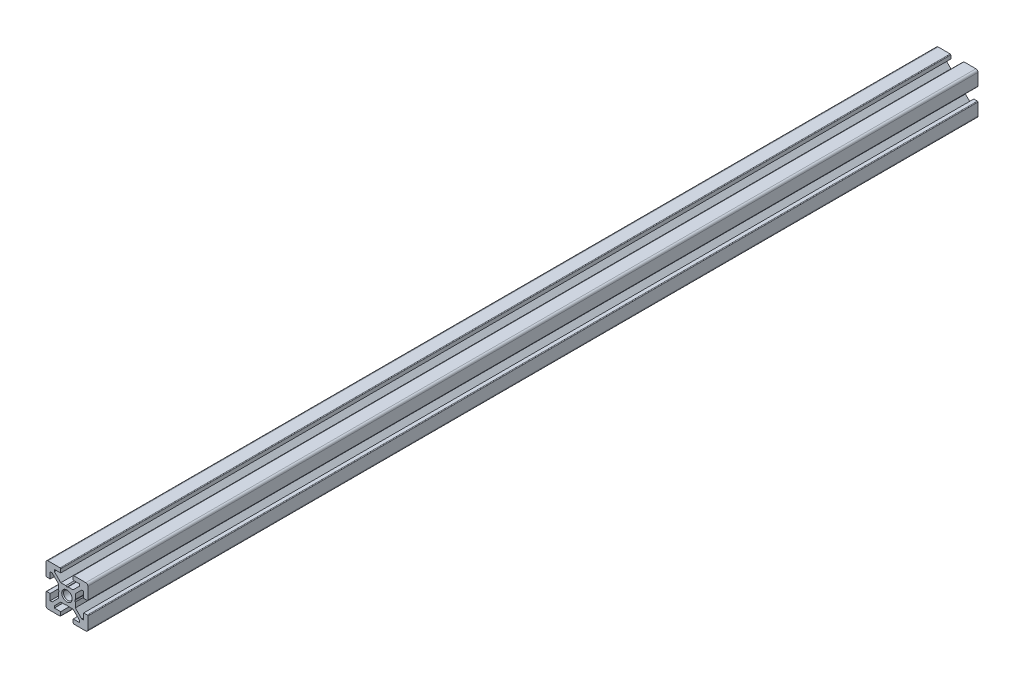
from build123d import *

# Parameters (mm, degrees)
BOSS_EXTRUDE1_DEPTH = 425


with BuildPart() as part:
    # Sketch1 → Boss-Extrude1 (new body)
    with BuildSketch(Plane.XY):
        with BuildLine():
            Line((-10, 9), (-10, 3.29999995))
            ThreePointArc((-10, 3.29999995), (-9.912132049, 3.087867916), (-9.7, 3))
            Line((-9.7, 3), (-8, 3))
            Line((-8, 3), (-8, 6))
            Line((-8, 6), (-7.060677, 6))
            Line((-7.060677, 6), (-4, 2.93932965))
            Line((-4, 2.93932965), (-4, 0.519615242))
            Line((-4, 0.519615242), (-3.699996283, -6.437e-06))
            Line((-3.699996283, -6.437e-06), (-4, -0.519628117))
            Line((-4, -0.519628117), (-4, -2.93933725))
            Line((-4, -2.93933725), (-7.0606695, -6))
            Line((-7.0606695, -6), (-8, -6))
            Line((-8, -6), (-8, -3))
            Line((-8, -3), (-9.7, -3))
            ThreePointArc((-9.7, -3), (-9.912132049, -3.087867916), (-10, -3.29999995))
            Line((-10, -3.29999995), (-10, -9))
            ThreePointArc((-10, -9), (-9.707106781, -9.707106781), (-9, -10))
            Line((-9, -10), (-3.29999995, -10))
            ThreePointArc((-3.29999995, -10), (-3.087867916, -9.912132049), (-3, -9.7))
            Line((-3, -9.7), (-3, -8))
            Line((-3, -8), (-6, -8))
            Line((-6, -8), (-6, -7.0606515))
            Line((-6, -7.0606515), (-2.9393489, -4))
            Line((-2.9393489, -4), (-0.519615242, -4))
            Line((-0.519615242, -4), (6.437e-06, -3.699996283))
            Line((6.437e-06, -3.699996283), (0.519628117, -4))
            Line((0.519628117, -4), (2.9393227, -4))
            Line((2.9393227, -4), (6, -7.060677))
            Line((6, -7.060677), (6, -8))
            Line((6, -8), (3, -8))
            Line((3, -8), (3, -9.7))
            ThreePointArc((3, -9.7), (3.087867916, -9.912132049), (3.29999995, -10))
            Line((3.29999995, -10), (9, -10))
            ThreePointArc((9, -10), (9.707106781, -9.707106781), (10, -9))
            Line((10, -9), (10, -3.29999995))
            ThreePointArc((10, -3.29999995), (9.912132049, -3.087867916), (9.7, -3))
            Line((9.7, -3), (8, -3))
            Line((8, -3), (8, -6))
            Line((8, -6), (7.0606435, -6))
            Line((7.0606435, -6), (4, -2.9393482))
            Line((4, -2.9393482), (4, -0.519615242))
            Line((4, -0.519615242), (3.699996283, 6.437e-06))
            Line((3.699996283, 6.437e-06), (4, 0.519628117))
            Line((4, 0.519628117), (4, 2.9393401))
            Line((4, 2.9393401), (7.060651, 6))
            Line((7.060651, 6), (8, 6))
            Line((8, 6), (8, 3))
            Line((8, 3), (9.7, 3))
            ThreePointArc((9.7, 3), (9.912132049, 3.087867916), (10, 3.29999995))
            Line((10, 3.29999995), (10, 9))
            ThreePointArc((10, 9), (9.707106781, 9.707106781), (9, 10))
            Line((9, 10), (3.29999995, 10))
            ThreePointArc((3.29999995, 10), (3.087867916, 9.912132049), (3, 9.7))
            Line((3, 9.7), (3, 8))
            Line((3, 8), (6, 8))
            Line((6, 8), (6, 7.060669))
            Line((6, 7.060669), (2.9393308, 4))
            Line((2.9393308, 4), (0.519615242, 4))
            Line((0.519615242, 4), (-6.437e-06, 3.699996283))
            Line((-6.437e-06, 3.699996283), (-0.519628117, 4))
            Line((-0.519628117, 4), (-2.93935655, 4))
            Line((-2.93935655, 4), (-6, 7.0606435))
            Line((-6, 7.0606435), (-6, 8))
            Line((-6, 8), (-3, 8))
            Line((-3, 8), (-3, 9.7))
            ThreePointArc((-3, 9.7), (-3.087867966, 9.912132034), (-3.3, 10))
            Line((-3.3, 10), (-9, 10))
            ThreePointArc((-9, 10), (-9.707106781, 9.707106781), (-10, 9))
        make_face()
    extrude(amount=-BOSS_EXTRUDE1_DEPTH)

    # Sketch2 → Cut-Revolve1 (revolve, cut)
    with BuildSketch(Plane(origin=(0, 0, 0), x_dir=(0, 0, -1), z_dir=(1, 0, 0)), mode=Mode.PRIVATE) as cut_revolve1_sk:
        Polygon((0, 0), (0, 2.5), (0.433, 2.067), (425, 2.067), (425, 0), align=None)
    revolve(cut_revolve1_sk.sketch.rotate(Axis((0, 0, -425), (0, 0, 1)), 270), axis=Axis((0, 0, -425), (0, 0, 1)), mode=Mode.SUBTRACT)

    # Sketch3 → Cut-Revolve2 (revolve, cut)
    with BuildSketch(Plane(origin=(0, 0, 0), x_dir=(0, 0, -1), z_dir=(1, 0, 0)), mode=Mode.PRIVATE) as cut_revolve2_sk:
        Polygon((0, 0), (0, 2.067), (424.567, 2.067), (425, 2.5), (425, 0), align=None)
    revolve(cut_revolve2_sk.sketch.rotate(Axis((0, 0, -425), (0, 0, 1)), 270), axis=Axis((0, 0, -425), (0, 0, 1)), mode=Mode.SUBTRACT)


solid = part.part
